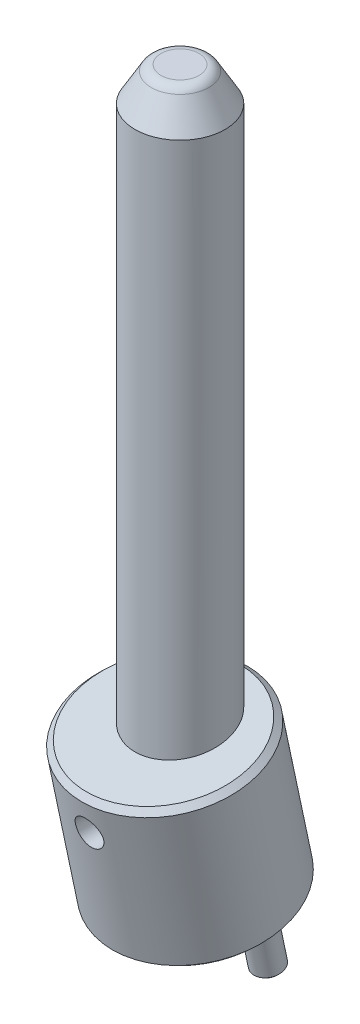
ISO-10303-21;
HEADER;
FILE_DESCRIPTION(('STEP AP214'),'2;1');
FILE_NAME('part.step','',(''),(''),'','','');
FILE_SCHEMA(('AUTOMOTIVE_DESIGN { 1 0 10303 214 1 1 1 1 }'));
ENDSEC;
DATA;
#1=APPLICATION_CONTEXT('core data for automotive mechanical design processes');
#2=APPLICATION_PROTOCOL_DEFINITION('international standard','automotive_design',2000,#1);
#3=PRODUCT_CONTEXT('',#1,'mechanical');
#4=PRODUCT('Part','Part','',(#3));
#5=PRODUCT_RELATED_PRODUCT_CATEGORY('part','',(#4));
#6=PRODUCT_DEFINITION_FORMATION('','',#4);
#7=PRODUCT_DEFINITION_CONTEXT('part definition',#1,'design');
#8=PRODUCT_DEFINITION('design','',#6,#7);
#9=PRODUCT_DEFINITION_SHAPE('','',#8);
#10=(LENGTH_UNIT() NAMED_UNIT(*) SI_UNIT(.MILLI.,.METRE.));
#11=(NAMED_UNIT(*) PLANE_ANGLE_UNIT() SI_UNIT($,.RADIAN.));
#12=(NAMED_UNIT(*) SI_UNIT($,.STERADIAN.) SOLID_ANGLE_UNIT());
#13=UNCERTAINTY_MEASURE_WITH_UNIT(LENGTH_MEASURE(1.E-05),#10,'distance_accuracy_value','');
#14=(GEOMETRIC_REPRESENTATION_CONTEXT(3) GLOBAL_UNCERTAINTY_ASSIGNED_CONTEXT((#13)) GLOBAL_UNIT_ASSIGNED_CONTEXT((#10,
#11,#12)) REPRESENTATION_CONTEXT('',''));
#15=CARTESIAN_POINT('',(0.,0.,0.));
#16=DIRECTION('',(0.,0.,1.));
#17=DIRECTION('',(1.,0.,0.));
#18=AXIS2_PLACEMENT_3D('',#15,#16,#17);
#19=CARTESIAN_POINT('',(0.,-11.3479748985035,-4.4464222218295));
#20=DIRECTION('',(0.,-0.978147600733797,-0.207911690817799));
#21=DIRECTION('',(0.,0.207911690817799,-0.978147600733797));
#22=AXIS2_PLACEMENT_3D('',#19,#20,#21);
#23=PLANE('',#22);
#24=CARTESIAN_POINT('',(-11.25,-11.3479748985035,-4.4464222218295));
#25=DIRECTION('',(0.,-0.978147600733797,-0.207911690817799));
#26=DIRECTION('',(0.,0.207911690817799,-0.978147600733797));
#27=AXIS2_PLACEMENT_3D('',#24,#25,#26);
#28=CIRCLE('',#27,1.9999654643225);
#29=CARTESIAN_POINT('',(-11.25,-10.932158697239,-6.402683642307));
#30=VERTEX_POINT('',#29);
#31=EDGE_CURVE('P0_E17',#30,#30,#28,.F.);
#32=ORIENTED_EDGE('',*,*,#31,.F.);
#33=EDGE_LOOP('',(#32));
#34=FACE_BOUND('',#33,.T.);
#35=ADVANCED_FACE('P0_F14',(#34),#23,.T.);
#36=CARTESIAN_POINT('',(0.,-11.3479748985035,-4.4464222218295));
#37=DIRECTION('',(0.,-0.978147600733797,-0.207911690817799));
#38=DIRECTION('',(0.,0.207911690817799,-0.978147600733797));
#39=AXIS2_PLACEMENT_3D('',#36,#37,#38);
#40=PLANE('',#39);
#41=CARTESIAN_POINT('',(11.25,-11.3479748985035,-4.4464222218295));
#42=DIRECTION('',(0.,-0.978147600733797,-0.207911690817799));
#43=DIRECTION('',(0.,0.207911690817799,-0.978147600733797));
#44=AXIS2_PLACEMENT_3D('',#41,#42,#43);
#45=CIRCLE('',#44,1.99996546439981);
#46=CARTESIAN_POINT('',(11.25,-10.9321586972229,-6.40268364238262));
#47=VERTEX_POINT('',#46);
#48=EDGE_CURVE('P0_E114',#47,#47,#45,.F.);
#49=ORIENTED_EDGE('',*,*,#48,.F.);
#50=EDGE_LOOP('',(#49));
#51=FACE_BOUND('',#50,.T.);
#52=ADVANCED_FACE('P0_F104',(#51),#40,.T.);
#53=CARTESIAN_POINT('',(0.,0.,-1.40946282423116E-13));
#54=DIRECTION('',(0.,-1.,0.));
#55=DIRECTION('',(0.,0.,-1.));
#56=AXIS2_PLACEMENT_3D('',#53,#54,#55);
#57=PLANE('',#56);
#58=CARTESIAN_POINT('',(0.,3.80771802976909E-13,4.43655528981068E-13));
#59=DIRECTION('',(0.,-1.,0.));
#60=DIRECTION('',(0.,0.,-1.));
#61=AXIS2_PLACEMENT_3D('',#58,#59,#60);
#62=CIRCLE('',#61,8.);
#63=CARTESIAN_POINT('',(0.,3.80771802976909E-13,-7.99999999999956));
#64=VERTEX_POINT('',#63);
#65=EDGE_CURVE('P0_E116',#64,#64,#62,.F.);
#66=ORIENTED_EDGE('',*,*,#65,.T.);
#67=EDGE_LOOP('',(#66));
#68=FACE_BOUND('',#67,.T.);
#69=ADVANCED_FACE('P0_F101',(#68),#57,.F.);
#70=CARTESIAN_POINT('',(-11.25,-10.858877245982,-4.34246130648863));
#71=DIRECTION('',(0.,0.978147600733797,0.207911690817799));
#72=DIRECTION('',(0.,-0.207911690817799,0.978147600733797));
#73=AXIS2_PLACEMENT_3D('',#70,#71,#72);
#74=CONICAL_SURFACE('',#73,2.49998121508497,0.78538952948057);
#75=CARTESIAN_POINT('',(-11.25,-10.8588588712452,-4.34245740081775));
#76=DIRECTION('',(0.,0.978147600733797,0.207911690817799));
#77=DIRECTION('',(0.,-0.207911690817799,0.978147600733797));
#78=AXIS2_PLACEMENT_3D('',#75,#76,#77);
#79=CIRCLE('',#78,2.5);
#80=CARTESIAN_POINT('',(-11.25,-11.3786380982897,-1.89708839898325));
#81=VERTEX_POINT('',#80);
#82=EDGE_CURVE('P0_E118',#81,#81,#79,.T.);
#83=ORIENTED_EDGE('',*,*,#82,.F.);
#84=EDGE_LOOP('',(#83));
#85=FACE_BOUND('',#84,.T.);
#86=ORIENTED_EDGE('',*,*,#31,.T.);
#87=EDGE_LOOP('',(#86));
#88=FACE_BOUND('',#87,.T.);
#89=ADVANCED_FACE('P0_F97',(#85,#88),#74,.T.);
#90=CARTESIAN_POINT('',(11.25,-10.858877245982,-4.34246130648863));
#91=DIRECTION('',(0.,0.978147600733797,0.207911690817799));
#92=DIRECTION('',(0.,-0.207911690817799,0.978147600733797));
#93=AXIS2_PLACEMENT_3D('',#90,#91,#92);
#94=CONICAL_SURFACE('',#93,2.49998121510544,0.785389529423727);
#95=CARTESIAN_POINT('',(11.25,-10.8588588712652,-4.342457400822));
#96=DIRECTION('',(0.,0.978147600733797,0.207911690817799));
#97=DIRECTION('',(0.,-0.207911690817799,0.978147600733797));
#98=AXIS2_PLACEMENT_3D('',#95,#96,#97);
#99=CIRCLE('',#98,2.5);
#100=CARTESIAN_POINT('',(11.25,-11.3786380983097,-1.89708839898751));
#101=VERTEX_POINT('',#100);
#102=EDGE_CURVE('P0_E123',#101,#101,#99,.T.);
#103=ORIENTED_EDGE('',*,*,#102,.F.);
#104=EDGE_LOOP('',(#103));
#105=FACE_BOUND('',#104,.T.);
#106=ORIENTED_EDGE('',*,*,#48,.T.);
#107=EDGE_LOOP('',(#106));
#108=FACE_BOUND('',#107,.T.);
#109=ADVANCED_FACE('P0_F92',(#105,#108),#94,.T.);
#110=CARTESIAN_POINT('',(0.,29.0896412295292,4.44522890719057E-13));
#111=DIRECTION('',(0.,-1.,0.));
#112=DIRECTION('',(0.,0.,-1.));
#113=AXIS2_PLACEMENT_3D('',#110,#111,#112);
#114=CYLINDRICAL_SURFACE('',#113,8.);
#115=CARTESIAN_POINT('',(0.,23.9999999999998,4.44089209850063E-13));
#116=DIRECTION('',(0.,0.978147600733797,0.207911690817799));
#117=DIRECTION('',(0.,-0.207911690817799,0.978147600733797));
#118=AXIS2_PLACEMENT_3D('',#115,#116,#117);
#119=ELLIPSE('',#118,8.17872475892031,8.);
#120=CARTESIAN_POINT('',(0.,22.2995475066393,8.00000000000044));
#121=VERTEX_POINT('',#120);
#122=EDGE_CURVE('P0_E79',#121,#121,#119,.F.);
#123=ORIENTED_EDGE('',*,*,#122,.F.);
#124=EDGE_LOOP('',(#123));
#125=FACE_BOUND('',#124,.T.);
#126=ORIENTED_EDGE('',*,*,#65,.F.);
#127=EDGE_LOOP('',(#126));
#128=FACE_BOUND('',#127,.T.);
#129=CARTESIAN_POINT('',(0.,16.5000000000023,8.00000000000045));
#130=CARTESIAN_POINT('',(-0.136696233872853,16.4999924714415,7.99999486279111));
#131=CARTESIAN_POINT('',(-0.273538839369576,16.4887368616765,7.99645812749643));
#132=CARTESIAN_POINT('',(-0.543359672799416,16.4440794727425,7.98267442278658));
#133=CARTESIAN_POINT('',(-0.676330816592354,16.4106394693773,7.97241587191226));
#134=CARTESIAN_POINT('',(-0.934271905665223,16.3228538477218,7.94631394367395));
#135=CARTESIAN_POINT('',(-1.05925832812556,16.2685530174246,7.93048253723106));
#136=CARTESIAN_POINT('',(-1.2983071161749,16.1407422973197,7.89487323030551));
#137=CARTESIAN_POINT('',(-1.4123711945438,16.0672354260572,7.87509595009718));
#138=CARTESIAN_POINT('',(-1.62992724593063,15.9006902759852,7.83300483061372));
#139=CARTESIAN_POINT('',(-1.73303436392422,15.8071632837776,7.8106355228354));
#140=CARTESIAN_POINT('',(-1.92239021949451,15.604269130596,7.76620212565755));
#141=CARTESIAN_POINT('',(-2.00863490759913,15.4948981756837,7.74413811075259));
#142=CARTESIAN_POINT('',(-2.16388692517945,15.2601105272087,7.70222283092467));
#143=CARTESIAN_POINT('',(-2.23241606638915,15.1343643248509,7.68243965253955));
#144=CARTESIAN_POINT('',(-2.34719509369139,14.87241459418,7.64815595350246));
#145=CARTESIAN_POINT('',(-2.3934509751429,14.7362138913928,7.63365401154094));
#146=CARTESIAN_POINT('',(-2.4609691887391,14.4615438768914,7.61215214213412));
#147=CARTESIAN_POINT('',(-2.48294218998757,14.3232663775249,7.60493946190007));
#148=CARTESIAN_POINT('',(-2.50349110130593,14.0448138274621,7.59820110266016));
#149=CARTESIAN_POINT('',(-2.50207322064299,13.9046392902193,7.59867338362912));
#150=CARTESIAN_POINT('',(-2.47643652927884,13.632251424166,7.60706377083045));
#151=CARTESIAN_POINT('',(-2.45312128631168,13.4999424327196,7.6146867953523));
#152=CARTESIAN_POINT('',(-2.38581648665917,13.2412163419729,7.63604044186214));
#153=CARTESIAN_POINT('',(-2.34182462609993,13.1147999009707,7.64977174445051));
#154=CARTESIAN_POINT('',(-2.23377596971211,12.8692925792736,7.68202134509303));
#155=CARTESIAN_POINT('',(-2.16943495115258,12.7503359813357,7.70060675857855));
#156=CARTESIAN_POINT('',(-2.02271557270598,12.5246183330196,7.74043834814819));
#157=CARTESIAN_POINT('',(-1.94033355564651,12.4178597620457,7.76168506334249));
#158=CARTESIAN_POINT('',(-1.75545127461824,12.2144687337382,7.80562654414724));
#159=CARTESIAN_POINT('',(-1.65220788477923,12.1185153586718,7.82834327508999));
#160=CARTESIAN_POINT('',(-1.43076939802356,11.9450838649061,7.87182395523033));
#161=CARTESIAN_POINT('',(-1.31256787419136,11.8676137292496,7.89258705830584));
#162=CARTESIAN_POINT('',(-1.06322528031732,11.7328853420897,7.93004255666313));
#163=CARTESIAN_POINT('',(-0.931982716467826,11.6758045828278,7.94669883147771));
#164=CARTESIAN_POINT('',(-0.661263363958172,11.5848318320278,7.97377752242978));
#165=CARTESIAN_POINT('',(-0.52180416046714,11.5508921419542,7.9842127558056));
#166=CARTESIAN_POINT('',(-0.317572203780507,11.5194323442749,7.99394471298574));
#167=CARTESIAN_POINT('',(-0.254308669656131,11.5121536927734,7.99620897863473));
#168=CARTESIAN_POINT('',(-0.127374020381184,11.5024357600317,7.99923782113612));
#169=CARTESIAN_POINT('',(-0.0637029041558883,11.4999964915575,8.00000239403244));
#170=CARTESIAN_POINT('',(0.136696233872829,11.500007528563,7.99999486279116));
#171=CARTESIAN_POINT('',(0.273538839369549,11.5112631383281,7.99645812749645));
#172=CARTESIAN_POINT('',(0.543359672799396,11.5559205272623,7.98267442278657));
#173=CARTESIAN_POINT('',(0.676330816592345,11.5893605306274,7.97241587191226));
#174=CARTESIAN_POINT('',(0.934271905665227,11.6771461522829,7.94631394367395));
#175=CARTESIAN_POINT('',(1.05925832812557,11.7314469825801,7.93048253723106));
#176=CARTESIAN_POINT('',(1.2983071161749,11.859257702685,7.89487323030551));
#177=CARTESIAN_POINT('',(1.4123711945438,11.9327645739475,7.87509595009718));
#178=CARTESIAN_POINT('',(1.62992724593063,12.0993097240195,7.83300483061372));
#179=CARTESIAN_POINT('',(1.73303436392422,12.1928367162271,7.8106355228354));
#180=CARTESIAN_POINT('',(1.92239021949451,12.3957308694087,7.76620212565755));
#181=CARTESIAN_POINT('',(2.00863490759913,12.505101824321,7.74413811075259));
#182=CARTESIAN_POINT('',(2.16388692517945,12.739889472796,7.70222283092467));
#183=CARTESIAN_POINT('',(2.23241606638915,12.8656356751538,7.68243965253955));
#184=CARTESIAN_POINT('',(2.34719509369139,13.1275854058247,7.64815595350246));
#185=CARTESIAN_POINT('',(2.3934509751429,13.2637861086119,7.63365401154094));
#186=CARTESIAN_POINT('',(2.4609691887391,13.5384561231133,7.61215214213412));
#187=CARTESIAN_POINT('',(2.48294218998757,13.6767336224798,7.60493946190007));
#188=CARTESIAN_POINT('',(2.50349110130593,13.9551861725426,7.59820110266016));
#189=CARTESIAN_POINT('',(2.50207322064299,14.0953607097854,7.59867338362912));
#190=CARTESIAN_POINT('',(2.47643652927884,14.3677485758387,7.60706377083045));
#191=CARTESIAN_POINT('',(2.45312128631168,14.5000575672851,7.6146867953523));
#192=CARTESIAN_POINT('',(2.38581648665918,14.7587836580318,7.63604044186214));
#193=CARTESIAN_POINT('',(2.34182462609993,14.885200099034,7.64977174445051));
#194=CARTESIAN_POINT('',(2.23377596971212,15.1307074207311,7.68202134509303));
#195=CARTESIAN_POINT('',(2.16943495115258,15.249664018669,7.70060675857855));
#196=CARTESIAN_POINT('',(2.02271557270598,15.4753816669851,7.74043834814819));
#197=CARTESIAN_POINT('',(1.94033355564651,15.582140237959,7.76168506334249));
#198=CARTESIAN_POINT('',(1.75545127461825,15.7855312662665,7.80562654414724));
#199=CARTESIAN_POINT('',(1.65220788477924,15.8814846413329,7.82834327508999));
#200=CARTESIAN_POINT('',(1.43076939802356,16.0549161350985,7.87182395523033));
#201=CARTESIAN_POINT('',(1.31256787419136,16.132386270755,7.89258705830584));
#202=CARTESIAN_POINT('',(1.06322528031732,16.267114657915,7.93004255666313));
#203=CARTESIAN_POINT('',(0.931982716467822,16.3241954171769,7.94669883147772));
#204=CARTESIAN_POINT('',(0.661263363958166,16.4151681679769,7.97377752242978));
#205=CARTESIAN_POINT('',(0.521804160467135,16.4491078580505,7.98421275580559));
#206=CARTESIAN_POINT('',(0.317572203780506,16.4805676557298,7.99394471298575));
#207=CARTESIAN_POINT('',(0.25430866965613,16.4878463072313,7.99620897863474));
#208=CARTESIAN_POINT('',(0.127374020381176,16.4975642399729,7.99923782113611));
#209=CARTESIAN_POINT('',(0.0637029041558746,16.5000035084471,8.00000239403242));
#210=CARTESIAN_POINT('',(0.,16.5000000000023,8.00000000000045));
#211=B_SPLINE_CURVE_WITH_KNOTS('',3,(#129,#130,#131,#132,#133,#134,#135,#136,#137,#138,#139,
#140,#141,#142,#143,#144,#145,#146,#147,#148,#149,#150,#151,#152,#153,#154,#155,#156,#157,#158,
#159,#160,#161,#162,#163,#164,#165,#166,#167,#168,#169,#170,#171,#172,#173,#174,#175,#176,#177,
#178,#179,#180,#181,#182,#183,#184,#185,#186,#187,#188,#189,#190,#191,#192,#193,#194,#195,#196,
#197,#198,#199,#200,#201,#202,#203,#204,#205,#206,#207,#208,#209,#210),.UNSPECIFIED.,.T.,.F.,(4,
2,2,2,2,2,2,2,2,2,2,2,2,2,2,2,2,2,2,2,2,2,2,2,2,2,2,2,2,2,2,2,2,2,2,2,2,2,2,2,4),(0.,
0.409843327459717,0.820394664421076,1.23006943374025,1.63967985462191,2.06074511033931,
2.48191136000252,2.91347666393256,3.34492573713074,3.76338291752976,4.18172901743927,
4.58353732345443,4.9853904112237,5.39312450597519,5.80094133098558,6.22725884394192,
6.65376015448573,7.08388858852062,7.51312773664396,7.70412159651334,7.89511596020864,
8.30495928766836,8.71551062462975,9.12518539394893,9.53479581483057,9.95586107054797,
10.3770273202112,10.8085926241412,11.2400416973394,11.6584988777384,12.0768449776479,
12.4786532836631,12.8805063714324,13.2882404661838,13.6960572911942,14.1223748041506,
14.5488761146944,14.9790045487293,15.4082436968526,15.599237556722,15.7902319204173),.UNSPECIFIED.);
#212=CARTESIAN_POINT('',(0.,16.5000000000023,8.00000000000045));
#213=VERTEX_POINT('',#212);
#214=EDGE_CURVE('P0_E76',#213,#213,#211,.T.);
#215=ORIENTED_EDGE('',*,*,#214,.T.);
#216=EDGE_LOOP('',(#215));
#217=FACE_BOUND('',#216,.T.);
#218=ADVANCED_FACE('P0_F86',(#125,#128,#217),#114,.F.);
#219=CARTESIAN_POINT('',(-11.25,-4.011867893,-2.887084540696));
#220=DIRECTION('',(0.,-0.978147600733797,-0.207911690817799));
#221=DIRECTION('',(0.,0.207911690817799,-0.978147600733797));
#222=AXIS2_PLACEMENT_3D('',#219,#220,#221);
#223=CYLINDRICAL_SURFACE('',#222,2.5);
#224=CARTESIAN_POINT('',(-11.25,-4.011867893,-2.887084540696));
#225=DIRECTION('',(0.,-0.978147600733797,-0.207911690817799));
#226=DIRECTION('',(0.,0.207911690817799,-0.978147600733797));
#227=AXIS2_PLACEMENT_3D('',#224,#225,#226);
#228=CIRCLE('',#227,2.5);
#229=CARTESIAN_POINT('',(-11.25,-3.4920886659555,-5.33245354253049));
#230=VERTEX_POINT('',#229);
#231=EDGE_CURVE('P0_E72',#230,#230,#228,.T.);
#232=ORIENTED_EDGE('',*,*,#231,.T.);
#233=EDGE_LOOP('',(#232));
#234=FACE_BOUND('',#233,.T.);
#235=ORIENTED_EDGE('',*,*,#82,.T.);
#236=EDGE_LOOP('',(#235));
#237=FACE_BOUND('',#236,.T.);
#238=ADVANCED_FACE('P0_F91',(#234,#237),#223,.T.);
#239=CARTESIAN_POINT('',(11.25,-4.011867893,-2.887084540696));
#240=DIRECTION('',(0.,-0.978147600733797,-0.207911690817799));
#241=DIRECTION('',(0.,0.207911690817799,-0.978147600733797));
#242=AXIS2_PLACEMENT_3D('',#239,#240,#241);
#243=CYLINDRICAL_SURFACE('',#242,2.5);
#244=CARTESIAN_POINT('',(11.25,-4.011867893,-2.887084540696));
#245=DIRECTION('',(0.,-0.978147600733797,-0.207911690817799));
#246=DIRECTION('',(0.,0.207911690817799,-0.978147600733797));
#247=AXIS2_PLACEMENT_3D('',#244,#245,#246);
#248=CIRCLE('',#247,2.5);
#249=CARTESIAN_POINT('',(11.25,-3.4920886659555,-5.33245354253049));
#250=VERTEX_POINT('',#249);
#251=EDGE_CURVE('P0_E68',#250,#250,#248,.T.);
#252=ORIENTED_EDGE('',*,*,#251,.T.);
#253=EDGE_LOOP('',(#252));
#254=FACE_BOUND('',#253,.T.);
#255=ORIENTED_EDGE('',*,*,#102,.T.);
#256=EDGE_LOOP('',(#255));
#257=FACE_BOUND('',#256,.T.);
#258=ADVANCED_FACE('P0_F139',(#254,#257),#243,.T.);
#259=CARTESIAN_POINT('',(0.,23.3762649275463,2.93444280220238));
#260=DIRECTION('',(0.,0.978147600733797,0.207911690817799));
#261=DIRECTION('',(0.,-0.207911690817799,0.978147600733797));
#262=AXIS2_PLACEMENT_3D('',#259,#260,#261);
#263=PLANE('',#262);
#264=ORIENTED_EDGE('',*,*,#122,.T.);
#265=EDGE_LOOP('',(#264));
#266=FACE_BOUND('',#265,.T.);
#267=CARTESIAN_POINT('',(0.,23.3762642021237,2.93444264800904));
#268=DIRECTION('',(0.,-0.978147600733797,-0.207911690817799));
#269=DIRECTION('',(0.,0.207911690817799,-0.978147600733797));
#270=AXIS2_PLACEMENT_3D('',#267,#268,#269);
#271=CIRCLE('',#270,13.999998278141);
#272=CARTESIAN_POINT('',(0.,26.2870275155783,-10.7596220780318));
#273=VERTEX_POINT('',#272);
#274=EDGE_CURVE('P0_E38',#273,#273,#271,.T.);
#275=ORIENTED_EDGE('',*,*,#274,.F.);
#276=EDGE_LOOP('',(#275));
#277=FACE_BOUND('',#276,.T.);
#278=ADVANCED_FACE('P0_F63',(#266,#277),#263,.T.);
#279=CARTESIAN_POINT('',(0.,14.0000000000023,-3.19382426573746));
#280=DIRECTION('',(0.,0.,1.));
#281=DIRECTION('',(0.,-1.,0.));
#282=AXIS2_PLACEMENT_3D('',#279,#280,#281);
#283=CYLINDRICAL_SURFACE('',#282,2.5);
#284=ORIENTED_EDGE('',*,*,#214,.F.);
#285=EDGE_LOOP('',(#284));
#286=FACE_BOUND('',#285,.T.);
#287=CARTESIAN_POINT('',(0.,11.5000000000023,15.7451736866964));
#288=CARTESIAN_POINT('',(-0.140107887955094,11.5000063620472,15.7451722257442));
#289=CARTESIAN_POINT('',(-0.280383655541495,11.5118241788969,15.7456579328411));
#290=CARTESIAN_POINT('',(-0.557146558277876,11.5588205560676,15.7477509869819));
#291=CARTESIAN_POINT('',(-0.693625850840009,11.5940442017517,15.7493604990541));
#292=CARTESIAN_POINT('',(-0.958652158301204,11.68684810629,15.7541401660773));
#293=CARTESIAN_POINT('',(-1.08720447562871,11.7444132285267,15.7573092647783));
#294=CARTESIAN_POINT('',(-1.33272880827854,11.880209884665,15.7658612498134));
#295=CARTESIAN_POINT('',(-1.44970582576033,11.9584324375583,15.7712431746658));
#296=CARTESIAN_POINT('',(-1.66863906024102,12.1331247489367,15.7849832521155));
#297=CARTESIAN_POINT('',(-1.770618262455,12.2295660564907,15.7933367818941));
#298=CARTESIAN_POINT('',(-1.95688343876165,12.4379077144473,15.8137776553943));
#299=CARTESIAN_POINT('',(-2.04116897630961,12.5498084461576,15.8258650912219));
#300=CARTESIAN_POINT('',(-2.18946472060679,12.7852827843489,15.8543210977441));
#301=CARTESIAN_POINT('',(-2.25354371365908,12.9088148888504,15.8706747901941));
#302=CARTESIAN_POINT('',(-2.3602000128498,13.1641747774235,15.9079831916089));
#303=CARTESIAN_POINT('',(-2.40277753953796,13.296002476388,15.9289378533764));
#304=CARTESIAN_POINT('',(-2.46571399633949,13.5647913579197,15.9754897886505));
#305=CARTESIAN_POINT('',(-2.48595736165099,13.7017754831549,16.0011104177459));
#306=CARTESIAN_POINT('',(-2.50367374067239,13.9763837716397,16.0564250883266));
#307=CARTESIAN_POINT('',(-2.50114389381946,14.1140080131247,16.0861196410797));
#308=CARTESIAN_POINT('',(-2.47343299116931,14.3895750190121,16.1494570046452));
#309=CARTESIAN_POINT('',(-2.44770367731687,14.5274444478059,16.1831781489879));
#310=CARTESIAN_POINT('',(-2.37382659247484,14.7965064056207,16.2526665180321));
#311=CARTESIAN_POINT('',(-2.32567388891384,14.9276974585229,16.2884341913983));
#312=CARTESIAN_POINT('',(-2.20639437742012,15.1842631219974,16.3616120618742));
#313=CARTESIAN_POINT('',(-2.13457256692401,15.3093107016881,16.3990378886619));
#314=CARTESIAN_POINT('',(-1.97029258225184,15.5455241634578,16.4724437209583));
#315=CARTESIAN_POINT('',(-1.8778333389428,15.6566893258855,16.5084236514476));
#316=CARTESIAN_POINT('',(-1.67389018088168,15.8625805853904,16.5770492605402));
#317=CARTESIAN_POINT('',(-1.56229929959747,15.9572078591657,16.6096744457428));
#318=CARTESIAN_POINT('',(-1.32321508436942,16.1261494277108,16.6692003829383));
#319=CARTESIAN_POINT('',(-1.19571842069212,16.200459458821,16.6960999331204));
#320=CARTESIAN_POINT('',(-0.934046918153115,16.3232708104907,16.7411944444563));
#321=CARTESIAN_POINT('',(-0.800368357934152,16.3727147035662,16.7597041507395));
#322=CARTESIAN_POINT('',(-0.525909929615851,16.4481759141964,16.7881514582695));
#323=CARTESIAN_POINT('',(-0.385150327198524,16.4742564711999,16.7981121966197));
#324=CARTESIAN_POINT('',(-0.202848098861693,16.4920900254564,16.8049293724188));
#325=CARTESIAN_POINT('',(-0.162348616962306,16.495053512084,16.8060629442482));
#326=CARTESIAN_POINT('',(-0.0812385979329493,16.4990094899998,16.8075770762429));
#327=CARTESIAN_POINT('',(-0.0406280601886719,16.5000019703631,16.8079576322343));
#328=CARTESIAN_POINT('',(0.134196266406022,16.4999934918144,16.8079527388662));
#329=CARTESIAN_POINT('',(0.268583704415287,16.4891374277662,16.8037846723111));
#330=CARTESIAN_POINT('',(0.533576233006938,16.4460970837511,16.7873961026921));
#331=CARTESIAN_POINT('',(0.664172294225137,16.4138656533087,16.7751577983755));
#332=CARTESIAN_POINT('',(0.917420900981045,16.3293993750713,16.7435328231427));
#333=CARTESIAN_POINT('',(1.04009312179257,16.2772164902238,16.7241647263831));
#334=CARTESIAN_POINT('',(1.2747246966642,16.1546700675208,16.6795542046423));
#335=CARTESIAN_POINT('',(1.38668719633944,16.0843118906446,16.6543135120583));
#336=CARTESIAN_POINT('',(1.60110639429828,15.9248164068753,16.5984986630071));
#337=CARTESIAN_POINT('',(1.70310445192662,15.8351170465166,16.5677710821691));
#338=CARTESIAN_POINT('',(1.8908718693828,15.6409920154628,16.5033463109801));
#339=CARTESIAN_POINT('',(1.97663559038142,15.5365612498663,16.4696480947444));
#340=CARTESIAN_POINT('',(2.13448955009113,15.3092616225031,16.3990336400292));
#341=CARTESIAN_POINT('',(2.20552533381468,15.1856820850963,16.3620433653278));
#342=CARTESIAN_POINT('',(2.32567188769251,14.9281418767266,16.2885349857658));
#343=CARTESIAN_POINT('',(2.37477922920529,14.7941795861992,16.2520169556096));
#344=CARTESIAN_POINT('',(2.45037879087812,14.5164913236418,16.1804008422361));
#345=CARTESIAN_POINT('',(2.47638794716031,14.3726216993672,16.145347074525));
#346=CARTESIAN_POINT('',(2.50292807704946,14.0817041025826,16.0789445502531));
#347=CARTESIAN_POINT('',(2.50346256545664,13.9346565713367,16.0475952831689));
#348=CARTESIAN_POINT('',(2.47884653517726,13.6450971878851,15.9902851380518));
#349=CARTESIAN_POINT('',(2.45427088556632,13.5025575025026,15.9642193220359));
#350=CARTESIAN_POINT('',(2.38060543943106,13.2230913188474,15.9171142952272));
#351=CARTESIAN_POINT('',(2.33152009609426,13.086163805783,15.8960741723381));
#352=CARTESIAN_POINT('',(2.21197910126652,12.8265805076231,15.8596129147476));
#353=CARTESIAN_POINT('',(2.14225849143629,12.7036080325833,15.8440333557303));
#354=CARTESIAN_POINT('',(1.98283632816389,12.4708667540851,15.8171865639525));
#355=CARTESIAN_POINT('',(1.89313780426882,12.3610959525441,15.8059186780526));
#356=CARTESIAN_POINT('',(1.69771009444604,12.1595628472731,15.7871579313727));
#357=CARTESIAN_POINT('',(1.5922254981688,12.0675678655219,15.7796139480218));
#358=CARTESIAN_POINT('',(1.36724037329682,11.9023500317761,15.7672958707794));
#359=CARTESIAN_POINT('',(1.24773397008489,11.829135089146,15.7625229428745));
#360=CARTESIAN_POINT('',(0.99791347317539,11.7035315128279,15.754998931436));
#361=CARTESIAN_POINT('',(0.867578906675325,11.6511834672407,15.7522517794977));
#362=CARTESIAN_POINT('',(0.600139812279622,11.5690883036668,15.7481884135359));
#363=CARTESIAN_POINT('',(0.463048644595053,11.5392983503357,15.7468694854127));
#364=CARTESIAN_POINT('',(0.270787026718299,11.514113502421,15.7457743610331));
#365=CARTESIAN_POINT('',(0.2167725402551,11.508825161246,15.7455479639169));
#366=CARTESIAN_POINT('',(0.108513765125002,11.5017671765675,15.7452479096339));
#367=CARTESIAN_POINT('',(0.054269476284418,11.499997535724,15.7451742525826));
#368=CARTESIAN_POINT('',(0.,11.5000000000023,15.7451736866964));
#369=B_SPLINE_CURVE_WITH_KNOTS('',3,(#287,#288,#289,#290,#291,#292,#293,#294,#295,#296,#297,
#298,#299,#300,#301,#302,#303,#304,#305,#306,#307,#308,#309,#310,#311,#312,#313,#314,#315,#316,
#317,#318,#319,#320,#321,#322,#323,#324,#325,#326,#327,#328,#329,#330,#331,#332,#333,#334,#335,
#336,#337,#338,#339,#340,#341,#342,#343,#344,#345,#346,#347,#348,#349,#350,#351,#352,#353,#354,
#355,#356,#357,#358,#359,#360,#361,#362,#363,#364,#365,#366,#367,#368),.UNSPECIFIED.,.T.,.F.,(4,
2,2,2,2,2,2,2,2,2,2,2,2,2,2,2,2,2,2,2,2,2,2,2,2,2,2,2,2,2,2,2,2,2,2,2,2,2,2,2,4),(0.,
0.420119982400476,0.841051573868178,1.26169847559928,1.68216279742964,2.10197585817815,
2.52179927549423,2.94017772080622,3.35855187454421,3.77908083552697,4.19966262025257,
4.63045198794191,5.06133616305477,5.50620682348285,5.95110053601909,6.39856803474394,
6.8461293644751,7.27512848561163,7.70296286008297,7.82479737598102,7.94663256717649,
8.34905955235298,8.75237718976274,9.15465147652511,9.55680724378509,9.97277727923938,
10.3888915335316,10.8286607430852,11.2684986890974,11.7173321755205,12.1661037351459,
12.604826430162,13.0434694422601,13.4680592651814,13.8925847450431,14.3111078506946,
14.7298069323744,15.1493164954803,15.5680274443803,15.7307568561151,15.8934863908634),.UNSPECIFIED.);
#370=CARTESIAN_POINT('',(0.,11.5000000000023,15.7451736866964));
#371=VERTEX_POINT('',#370);
#372=EDGE_CURVE('P0_E31',#371,#371,#369,.T.);
#373=ORIENTED_EDGE('',*,*,#372,.F.);
#374=EDGE_LOOP('',(#373));
#375=FACE_BOUND('',#374,.T.);
#376=ADVANCED_FACE('P0_F40',(#286,#375),#283,.F.);
#377=CARTESIAN_POINT('',(0.,-4.011867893,-2.887084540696));
#378=DIRECTION('',(0.,0.978147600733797,0.207911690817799));
#379=DIRECTION('',(0.,-0.207911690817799,0.978147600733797));
#380=AXIS2_PLACEMENT_3D('',#377,#378,#379);
#381=PLANE('',#380);
#382=ORIENTED_EDGE('',*,*,#251,.F.);
#383=EDGE_LOOP('',(#382));
#384=FACE_BOUND('',#383,.T.);
#385=ORIENTED_EDGE('',*,*,#231,.F.);
#386=EDGE_LOOP('',(#385));
#387=FACE_BOUND('',#386,.T.);
#388=CARTESIAN_POINT('',(0.,-4.01186714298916,-2.88708438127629));
#389=DIRECTION('',(0.,0.978147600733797,0.207911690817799));
#390=DIRECTION('',(0.,-0.207911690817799,0.978147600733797));
#391=AXIS2_PLACEMENT_3D('',#388,#389,#390);
#392=CIRCLE('',#391,13.99999802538);
#393=CARTESIAN_POINT('',(0.,-6.92263040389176,10.806980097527));
#394=VERTEX_POINT('',#393);
#395=EDGE_CURVE('P0_E26',#394,#394,#392,.T.);
#396=ORIENTED_EDGE('',*,*,#395,.F.);
#397=EDGE_LOOP('',(#396));
#398=FACE_BOUND('',#397,.T.);
#399=ADVANCED_FACE('P0_F55',(#384,#387,#398),#381,.F.);
#400=CARTESIAN_POINT('',(0.,22.3981155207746,2.72653072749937));
#401=DIRECTION('',(0.,-0.978147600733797,-0.207911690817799));
#402=DIRECTION('',(0.,0.207911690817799,-0.978147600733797));
#403=AXIS2_PLACEMENT_3D('',#400,#401,#402);
#404=CONICAL_SURFACE('',#403,14.999999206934,0.785398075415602);
#405=ORIENTED_EDGE('',*,*,#274,.T.);
#406=EDGE_LOOP('',(#405));
#407=FACE_BOUND('',#406,.T.);
#408=CARTESIAN_POINT('',(0.,22.3981162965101,2.72653089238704));
#409=DIRECTION('',(0.,0.978147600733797,0.207911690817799));
#410=DIRECTION('',(0.,-0.207911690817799,0.978147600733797));
#411=AXIS2_PLACEMENT_3D('',#408,#409,#410);
#412=CIRCLE('',#411,15.);
#413=CARTESIAN_POINT('',(0.,19.2794409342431,17.398744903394));
#414=VERTEX_POINT('',#413);
#415=EDGE_CURVE('P0_E21',#414,#414,#412,.F.);
#416=ORIENTED_EDGE('',*,*,#415,.F.);
#417=EDGE_LOOP('',(#416));
#418=FACE_BOUND('',#417,.T.);
#419=ADVANCED_FACE('P0_F52',(#407,#418),#404,.T.);
#420=CARTESIAN_POINT('',(0.,-3.03371822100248,-2.67917240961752));
#421=DIRECTION('',(0.,0.978147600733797,0.207911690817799));
#422=DIRECTION('',(0.,-0.207911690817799,0.978147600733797));
#423=AXIS2_PLACEMENT_3D('',#420,#421,#422);
#424=CONICAL_SURFACE('',#423,14.9999991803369,0.785398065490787);
#425=CARTESIAN_POINT('',(0.,-3.03371902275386,-2.67917258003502));
#426=DIRECTION('',(0.,0.978147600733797,0.207911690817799));
#427=DIRECTION('',(0.,-0.207911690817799,0.978147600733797));
#428=AXIS2_PLACEMENT_3D('',#425,#426,#427);
#429=CIRCLE('',#428,15.);
#430=CARTESIAN_POINT('',(0.,-6.15239438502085,11.9930414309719));
#431=VERTEX_POINT('',#430);
#432=EDGE_CURVE('P0_E9',#431,#431,#429,.T.);
#433=ORIENTED_EDGE('',*,*,#432,.F.);
#434=EDGE_LOOP('',(#433));
#435=FACE_BOUND('',#434,.T.);
#436=ORIENTED_EDGE('',*,*,#395,.T.);
#437=EDGE_LOOP('',(#436));
#438=FACE_BOUND('',#437,.T.);
#439=ADVANCED_FACE('P0_F48',(#435,#438),#424,.T.);
#440=CARTESIAN_POINT('',(0.,-5.38127453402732,-3.17816090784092));
#441=DIRECTION('',(0.,0.978147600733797,0.207911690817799));
#442=DIRECTION('',(0.,-0.207911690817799,0.978147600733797));
#443=AXIS2_PLACEMENT_3D('',#440,#441,#442);
#444=CYLINDRICAL_SURFACE('',#443,15.);
#445=ORIENTED_EDGE('',*,*,#415,.T.);
#446=EDGE_LOOP('',(#445));
#447=FACE_BOUND('',#446,.T.);
#448=ORIENTED_EDGE('',*,*,#432,.T.);
#449=EDGE_LOOP('',(#448));
#450=FACE_BOUND('',#449,.T.);
#451=ORIENTED_EDGE('',*,*,#372,.T.);
#452=EDGE_LOOP('',(#451));
#453=FACE_BOUND('',#452,.T.);
#454=ADVANCED_FACE('P0_F44',(#447,#450,#453),#444,.T.);
#455=CLOSED_SHELL('',(#35,#52,#69,#89,#109,#218,#238,#258,#278,#376,#399,#419,#439,#454));
#456=MANIFOLD_SOLID_BREP('P0_B1',#455);
#457=CARTESIAN_POINT('',(0.,124.,0.));
#458=DIRECTION('',(0.,1.,0.));
#459=DIRECTION('',(-1.,0.,0.));
#460=AXIS2_PLACEMENT_3D('',#457,#458,#459);
#461=PLANE('',#460);
#462=CARTESIAN_POINT('',(0.,124.,-3.381197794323));
#463=CARTESIAN_POINT('',(0.0491775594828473,124.,-3.38119852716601));
#464=CARTESIAN_POINT('',(0.0983550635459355,124.,-3.38012493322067));
#465=CARTESIAN_POINT('',(0.196616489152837,124.,-3.3758343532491));
#466=CARTESIAN_POINT('',(0.24570041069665,124.,-3.37261736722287));
#467=CARTESIAN_POINT('',(0.343681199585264,124.,-3.36404526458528));
#468=CARTESIAN_POINT('',(0.392578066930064,124.,-3.35869014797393));
#469=CARTESIAN_POINT('',(0.490091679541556,124.,-3.34585220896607));
#470=CARTESIAN_POINT('',(0.538708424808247,124.,-3.33836938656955));
#471=CARTESIAN_POINT('',(0.635569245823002,124.,-3.32129021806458));
#472=CARTESIAN_POINT('',(0.683813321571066,124.,-3.31169387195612));
#473=CARTESIAN_POINT('',(0.779836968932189,124.,-3.29040593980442));
#474=CARTESIAN_POINT('',(0.827616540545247,124.,-3.27871435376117));
#475=CARTESIAN_POINT('',(0.922620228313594,124.,-3.25325819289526));
#476=CARTESIAN_POINT('',(0.969844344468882,124.,-3.2394936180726));
#477=CARTESIAN_POINT('',(1.06364722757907,124.,-3.20991768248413));
#478=CARTESIAN_POINT('',(1.11022599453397,124.,-3.19410632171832));
#479=CARTESIAN_POINT('',(1.2026495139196,124.,-3.1604669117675));
#480=CARTESIAN_POINT('',(1.24849426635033,124.,-3.14263886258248));
#481=CARTESIAN_POINT('',(1.33936248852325,124.,-3.10500001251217));
#482=CARTESIAN_POINT('',(1.38438595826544,124.,-3.08518921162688));
#483=CARTESIAN_POINT('',(1.47352591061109,124.,-3.04362256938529));
#484=CARTESIAN_POINT('',(1.51764239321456,124.,-3.02186672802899));
#485=CARTESIAN_POINT('',(1.60488439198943,124.,-2.97645141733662));
#486=CARTESIAN_POINT('',(1.64800990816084,124.,-2.95279194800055));
#487=CARTESIAN_POINT('',(1.73318788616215,124.,-2.90361442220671));
#488=CARTESIAN_POINT('',(1.77524034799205,124.,-2.87809636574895));
#489=CARTESIAN_POINT('',(1.85819215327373,124.,-2.82525022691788));
#490=CARTESIAN_POINT('',(1.89909149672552,124.,-2.79792214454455));
#491=CARTESIAN_POINT('',(1.97965926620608,124.,-2.74150802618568));
#492=CARTESIAN_POINT('',(2.01932769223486,124.,-2.71242199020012));
#493=CARTESIAN_POINT('',(2.09735790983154,124.,-2.65254713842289));
#494=CARTESIAN_POINT('',(2.13571970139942,123.999999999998,-2.62175832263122));
#495=CARTESIAN_POINT('',(2.21106439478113,124.000000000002,-2.55853724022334));
#496=CARTESIAN_POINT('',(2.24804729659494,124.000000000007,-2.52610497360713));
#497=CARTESIAN_POINT('',(2.32056094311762,123.999999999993,-2.45965603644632));
#498=CARTESIAN_POINT('',(2.35609168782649,123.999999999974,-2.42563936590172));
#499=CARTESIAN_POINT('',(2.42705213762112,124.000000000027,-2.35468855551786));
#500=CARTESIAN_POINT('',(2.46241950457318,124.000000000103,-2.31769205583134));
#501=CARTESIAN_POINT('',(2.53146011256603,123.999999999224,-2.24214947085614));
#502=CARTESIAN_POINT('',(2.56513331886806,123.999999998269,-2.20360335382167));
#503=CARTESIAN_POINT('',(2.63071590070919,123.99999999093,-2.12503640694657));
#504=CARTESIAN_POINT('',(2.66262520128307,123.999999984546,-2.08501551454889));
#505=CARTESIAN_POINT('',(2.72461562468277,123.999999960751,-2.00357584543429));
#506=CARTESIAN_POINT('',(2.75469662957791,123.999999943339,-1.96215697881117));
#507=CARTESIAN_POINT('',(2.79840512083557,123.999999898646,-1.89905244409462));
#508=CARTESIAN_POINT('',(2.81273996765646,123.999999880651,-1.87785353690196));
#509=CARTESIAN_POINT('',(2.84090934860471,123.999999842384,-1.83514783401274));
#510=CARTESIAN_POINT('',(2.8547442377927,123.999999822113,-1.81364127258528));
#511=CARTESIAN_POINT('',(2.8954872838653,123.999999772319,-1.7486424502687));
#512=CARTESIAN_POINT('',(2.921634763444,123.999999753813,-1.7046696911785));
#513=CARTESIAN_POINT('',(2.97183520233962,123.999999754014,-1.61554840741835));
#514=CARTESIAN_POINT('',(2.99588817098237,123.99999977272,-1.57039988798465));
#515=CARTESIAN_POINT('',(3.04188859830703,123.999999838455,-1.47904330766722));
#516=CARTESIAN_POINT('',(3.06383619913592,123.999999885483,-1.4328353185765));
#517=CARTESIAN_POINT('',(3.10541271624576,123.999999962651,-1.33939702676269));
#518=CARTESIAN_POINT('',(3.12504193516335,123.999999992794,-1.2921668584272));
#519=CARTESIAN_POINT('',(3.15291976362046,124.000000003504,-1.22146858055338));
#520=CARTESIAN_POINT('',(3.16183489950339,124.000000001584,-1.19825675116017));
#521=CARTESIAN_POINT('',(3.1990199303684,123.999999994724,-1.09818755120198));
#522=CARTESIAN_POINT('',(3.22479363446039,123.999999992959,-1.02037068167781));
#523=CARTESIAN_POINT('',(3.25883872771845,123.999999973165,-0.903503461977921));
#524=CARTESIAN_POINT('',(3.269300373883,123.999999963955,-0.865070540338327));
#525=CARTESIAN_POINT('',(3.29035807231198,123.999999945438,-0.781874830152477));
#526=CARTESIAN_POINT('',(3.30072437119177,123.999999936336,-0.737052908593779));
#527=CARTESIAN_POINT('',(3.31424558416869,123.999999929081,-0.672514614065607));
#528=CARTESIAN_POINT('',(3.31816009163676,123.999999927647,-0.652953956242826));
#529=CARTESIAN_POINT('',(3.3263206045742,123.999999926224,-0.610180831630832));
#530=CARTESIAN_POINT('',(3.33049626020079,123.999999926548,-0.58695489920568));
#531=CARTESIAN_POINT('',(3.34228609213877,123.999999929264,-0.517153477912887));
#532=CARTESIAN_POINT('',(3.34916374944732,123.999999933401,-0.470451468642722));
#533=CARTESIAN_POINT('',(3.36093725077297,123.999999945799,-0.376800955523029));
#534=CARTESIAN_POINT('',(3.36583314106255,123.999999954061,-0.329852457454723));
#535=CARTESIAN_POINT('',(3.37363894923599,123.999999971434,-0.235792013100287));
#536=CARTESIAN_POINT('',(3.37654894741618,123.999999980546,-0.188680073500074));
#537=CARTESIAN_POINT('',(3.38036477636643,123.999999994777,-0.0943781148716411));
#538=CARTESIAN_POINT('',(3.38127072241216,123.999999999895,-0.0471881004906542));
#539=CARTESIAN_POINT('',(3.38112480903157,124.000000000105,0.047225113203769));
#540=CARTESIAN_POINT('',(3.38007141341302,123.999999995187,0.0944483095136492));
#541=CARTESIAN_POINT('',(3.37605062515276,123.999999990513,0.188811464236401));
#542=CARTESIAN_POINT('',(3.37308328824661,123.999999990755,0.235951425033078));
#543=CARTESIAN_POINT('',(3.36523468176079,123.99999999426,0.330073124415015));
#544=CARTESIAN_POINT('',(3.36035337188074,123.999999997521,0.377054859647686));
#545=CARTESIAN_POINT('',(3.34865879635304,124.000000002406,0.470780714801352));
#546=CARTESIAN_POINT('',(3.34184539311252,124.000000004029,0.517524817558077));
#547=CARTESIAN_POINT('',(3.3302655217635,123.999999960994,0.58741597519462));
#548=CARTESIAN_POINT('',(3.3261786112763,123.999999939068,0.610677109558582));
#549=CARTESIAN_POINT('',(3.32001382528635,123.999999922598,0.64332853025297));
#550=CARTESIAN_POINT('',(3.31818160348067,123.999999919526,0.65276518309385));
#551=CARTESIAN_POINT('',(3.30790809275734,123.999999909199,0.704387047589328));
#552=CARTESIAN_POINT('',(3.2986277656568,123.999999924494,0.746407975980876));
#553=CARTESIAN_POINT('',(3.27611885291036,123.999999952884,0.839847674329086));
#554=CARTESIAN_POINT('',(3.26247449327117,123.999999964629,0.891165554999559));
#555=CARTESIAN_POINT('',(3.22698341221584,123.999999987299,1.01297067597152));
#556=CARTESIAN_POINT('',(3.20401223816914,123.999999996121,1.08313569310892));
#557=CARTESIAN_POINT('',(3.16757439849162,124.00000000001,1.18334601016));
#558=CARTESIAN_POINT('',(3.15590282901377,123.999999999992,1.21405838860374));
#559=CARTESIAN_POINT('',(3.12494638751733,124.000000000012,1.29216796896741));
#560=CARTESIAN_POINT('',(3.10504413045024,124.000000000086,1.33932319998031));
#561=CARTESIAN_POINT('',(3.06313614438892,123.999999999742,1.43268851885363));
#562=CARTESIAN_POINT('',(3.0411303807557,123.999999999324,1.47889859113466));
#563=CARTESIAN_POINT('',(2.9950713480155,123.999999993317,1.57028914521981));
#564=CARTESIAN_POINT('',(2.97101799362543,123.999999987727,1.61546958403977));
#565=CARTESIAN_POINT('',(2.92090425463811,123.99999996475,1.70470923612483));
#566=CARTESIAN_POINT('',(2.89484373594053,123.999999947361,1.7487683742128));
#567=CARTESIAN_POINT('',(2.8542985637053,123.9999999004,1.81395013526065));
#568=CARTESIAN_POINT('',(2.8405401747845,123.999999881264,1.83552759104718));
#569=CARTESIAN_POINT('',(2.81254197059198,123.999999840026,1.87834577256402));
#570=CARTESIAN_POINT('',(2.79830250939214,123.999999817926,1.89958672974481));
#571=CARTESIAN_POINT('',(2.75484041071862,123.999999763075,1.96280026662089));
#572=CARTESIAN_POINT('',(2.72487327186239,123.999999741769,2.00426477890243));
#573=CARTESIAN_POINT('',(2.66302492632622,123.999999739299,2.08573639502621));
#574=CARTESIAN_POINT('',(2.63114372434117,123.999999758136,2.12574350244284));
#575=CARTESIAN_POINT('',(2.56557045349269,123.999999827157,2.20424439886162));
#576=CARTESIAN_POINT('',(2.53187850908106,123.99999987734,2.24273829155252));
#577=CARTESIAN_POINT('',(2.46263073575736,123.999999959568,2.31799882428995));
#578=CARTESIAN_POINT('',(2.42707515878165,123.999999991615,2.35476569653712));
#579=CARTESIAN_POINT('',(2.37140677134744,124.000000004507,2.41027252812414));
#580=CARTESIAN_POINT('',(2.35175738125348,124.000000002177,2.42948514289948));
#581=CARTESIAN_POINT('',(2.26802085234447,123.999999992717,2.50941121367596));
#582=CARTESIAN_POINT('',(2.20177871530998,123.999999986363,2.56792039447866));
#583=CARTESIAN_POINT('',(2.10003782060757,123.999999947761,2.65091291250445));
#584=CARTESIAN_POINT('',(2.06619123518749,123.999999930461,2.67746023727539));
#585=CARTESIAN_POINT('',(1.99205588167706,123.999999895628,2.73332764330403));
#586=CARTESIAN_POINT('',(1.95159524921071,123.999999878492,2.76242170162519));
#587=CARTESIAN_POINT('',(1.89261855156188,123.99999986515,2.80284358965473));
#588=CARTESIAN_POINT('',(1.8746141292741,123.999999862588,2.81492542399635));
#589=CARTESIAN_POINT('',(1.83512217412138,123.99999986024,2.84086885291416));
#590=CARTESIAN_POINT('',(1.81358900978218,123.999999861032,2.85466108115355));
#591=CARTESIAN_POINT('',(1.7485251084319,123.999999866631,2.89529179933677));
#592=CARTESIAN_POINT('',(1.70452676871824,123.999999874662,2.92138652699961));
#593=CARTESIAN_POINT('',(1.61538182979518,123.999999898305,2.97152713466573));
#594=CARTESIAN_POINT('',(1.57023526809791,123.999999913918,2.99557308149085));
#595=CARTESIAN_POINT('',(1.47889045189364,123.999999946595,3.04157160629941));
#596=CARTESIAN_POINT('',(1.43269225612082,123.99999996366,3.06352430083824));
#597=CARTESIAN_POINT('',(1.33933610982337,123.999999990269,3.10527343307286));
#598=CARTESIAN_POINT('',(1.29217823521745,123.999999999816,3.12507004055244));
#599=CARTESIAN_POINT('',(1.20065831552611,124.00000000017,3.16109559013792));
#600=CARTESIAN_POINT('',(1.15635789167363,123.999999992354,3.17748154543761));
#601=CARTESIAN_POINT('',(1.06713504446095,123.999999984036,3.20845589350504));
#602=CARTESIAN_POINT('',(1.02221264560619,123.999999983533,3.22304435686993));
#603=CARTESIAN_POINT('',(0.931813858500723,123.999999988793,3.25039463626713));
#604=CARTESIAN_POINT('',(0.886337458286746,123.999999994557,3.26315641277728));
#605=CARTESIAN_POINT('',(0.794895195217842,124.000000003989,3.28680491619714));
#606=CARTESIAN_POINT('',(0.74892929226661,124.000000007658,3.2976914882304));
#607=CARTESIAN_POINT('',(0.686121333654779,123.999999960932,3.31129818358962));
#608=CARTESIAN_POINT('',(0.669443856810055,123.999999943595,3.31479031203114));
#609=CARTESIAN_POINT('',(0.639370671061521,123.999999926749,3.32077891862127));
#610=CARTESIAN_POINT('',(0.625986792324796,123.999999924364,3.32333471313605));
#611=CARTESIAN_POINT('',(0.56478186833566,123.999999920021,3.33461824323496));
#612=CARTESIAN_POINT('',(0.516772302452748,123.999999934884,3.34234416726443));
#613=CARTESIAN_POINT('',(0.428809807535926,123.999999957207,3.35455837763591));
#614=CARTESIAN_POINT('',(0.388901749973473,123.999999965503,3.35937566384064));
#615=CARTESIAN_POINT('',(0.315880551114,123.99999997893,3.36686744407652));
#616=CARTESIAN_POINT('',(0.282790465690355,123.999999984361,3.36976874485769));
#617=CARTESIAN_POINT('',(0.198641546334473,123.999999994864,3.37590122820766));
#618=CARTESIAN_POINT('',(0.147531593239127,123.999999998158,3.3784640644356));
#619=CARTESIAN_POINT('',(0.077559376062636,123.999999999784,3.38039422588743));
#620=CARTESIAN_POINT('',(0.0587195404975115,123.999999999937,3.38075747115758));
#621=CARTESIAN_POINT('',(0.0265859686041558,124.000000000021,3.38112029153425));
#622=CARTESIAN_POINT('',(0.0132930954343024,124.000000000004,3.38119546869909));
#623=CARTESIAN_POINT('',(0.,124.,3.381197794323));
#624=B_SPLINE_CURVE_WITH_KNOTS('',3,(#462,#463,#464,#465,#466,#467,#468,#469,#470,#471,#472,
#473,#474,#475,#476,#477,#478,#479,#480,#481,#482,#483,#484,#485,#486,#487,#488,#489,#490,#491,
#492,#493,#494,#495,#496,#497,#498,#499,#500,#501,#502,#503,#504,#505,#506,#507,#508,#509,#510,
#511,#512,#513,#514,#515,#516,#517,#518,#519,#520,#521,#522,#523,#524,#525,#526,#527,#528,#529,
#530,#531,#532,#533,#534,#535,#536,#537,#538,#539,#540,#541,#542,#543,#544,#545,#546,#547,#548,
#549,#550,#551,#552,#553,#554,#555,#556,#557,#558,#559,#560,#561,#562,#563,#564,#565,#566,#567,
#568,#569,#570,#571,#572,#573,#574,#575,#576,#577,#578,#579,#580,#581,#582,#583,#584,#585,#586,
#587,#588,#589,#590,#591,#592,#593,#594,#595,#596,#597,#598,#599,#600,#601,#602,#603,#604,#605,
#606,#607,#608,#609,#610,#611,#612,#613,#614,#615,#616,#617,#618,#619,#620,#621,#622,#623),
.UNSPECIFIED.,.F.,.F.,(4,2,2,2,2,2,2,2,2,2,2,2,2,2,2,2,2,2,2,2,2,2,2,2,2,2,2,2,2,2,2,2,2,2,2,2,
2,2,2,2,2,2,2,2,2,2,2,2,2,2,2,2,2,2,2,2,2,2,2,2,2,2,2,2,2,2,2,2,2,2,2,2,2,2,2,2,2,2,2,2,4),(0.,
0.147520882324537,0.295041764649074,0.442562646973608,0.590083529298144,0.737604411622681,
0.885125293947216,1.03264617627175,1.18016705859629,1.32768794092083,1.47520882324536,
1.6227297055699,1.77025058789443,1.91777147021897,2.06529235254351,2.21281323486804,
2.36033411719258,2.50785499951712,2.65537588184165,2.8088697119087,2.96236668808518,
3.11587018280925,3.26938356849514,3.34614986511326,3.42286052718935,3.57627688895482,
3.72969256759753,3.88309788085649,4.03648314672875,4.11107818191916,4.35672730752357,
4.47620511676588,4.61417295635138,4.67401611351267,4.74480627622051,4.88637772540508,
5.02794586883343,5.16950828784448,5.31106256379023,5.45272787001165,5.59438905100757,
5.73605321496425,5.87772746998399,5.94857427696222,5.97741258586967,6.10647459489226,
6.2657256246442,6.48702972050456,6.58558753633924,6.73908100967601,6.89257701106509,
7.0460794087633,7.19959207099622,7.27635828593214,7.35306918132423,7.50648650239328,
7.65990344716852,7.81330986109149,7.96669558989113,8.04913919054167,8.31394403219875,
8.4429705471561,8.59241517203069,8.6574595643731,8.73416806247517,8.88757342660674,
9.04097378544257,9.19436559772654,9.34774532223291,9.48940808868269,9.63106528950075,
9.77272555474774,9.9143975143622,9.96551300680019,10.0063890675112,10.1522163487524,
10.2727850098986,10.3724238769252,10.5258841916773,10.5824125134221,10.622291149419),.UNSPECIFIED.);
#625=CARTESIAN_POINT('',(0.,124.,-3.381197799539));
#626=VERTEX_POINT('',#625);
#627=CARTESIAN_POINT('',(0.,124.,3.381197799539));
#628=VERTEX_POINT('',#627);
#629=EDGE_CURVE('P1_E38',#626,#628,#624,.T.);
#630=ORIENTED_EDGE('',*,*,#629,.F.);
#631=CARTESIAN_POINT('',(0.,124.,0.));
#632=DIRECTION('',(0.,-1.,0.));
#633=DIRECTION('',(0.,0.,1.));
#634=AXIS2_PLACEMENT_3D('',#631,#632,#633);
#635=CIRCLE('',#634,3.381197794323);
#636=EDGE_CURVE('P1_E42',#628,#626,#635,.T.);
#637=ORIENTED_EDGE('',*,*,#636,.F.);
#638=EDGE_LOOP('',(#630,#637));
#639=FACE_BOUND('',#638,.T.);
#640=ADVANCED_FACE('P1_F17',(#639),#461,.T.);
#641=CARTESIAN_POINT('',(0.,122.,0.));
#642=DIRECTION('',(0.,1.,0.));
#643=DIRECTION('',(0.0117940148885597,0.,0.999930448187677));
#644=AXIS2_PLACEMENT_3D('',#641,#642,#643);
#645=TOROIDAL_SURFACE('',#644,3.381197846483,2.);
#646=ORIENTED_EDGE('',*,*,#629,.T.);
#647=ORIENTED_EDGE('',*,*,#636,.T.);
#648=EDGE_LOOP('',(#646,#647));
#649=FACE_BOUND('',#648,.T.);
#650=CARTESIAN_POINT('',(0.,123.000000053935,0.));
#651=DIRECTION('',(0.,-1.,0.));
#652=DIRECTION('',(0.,0.,1.));
#653=AXIS2_PLACEMENT_3D('',#650,#651,#652);
#654=CIRCLE('',#653,5.11324862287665);
#655=CARTESIAN_POINT('',(0.,123.000000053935,5.11324862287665));
#656=VERTEX_POINT('',#655);
#657=EDGE_CURVE('P1_E48',#656,#656,#654,.T.);
#658=ORIENTED_EDGE('',*,*,#657,.F.);
#659=EDGE_LOOP('',(#658));
#660=FACE_BOUND('',#659,.T.);
#661=ADVANCED_FACE('P1_F40',(#649,#660),#645,.T.);
#662=CARTESIAN_POINT('',(0.,0.,0.));
#663=DIRECTION('',(0.,1.,0.));
#664=DIRECTION('',(-1.,0.,0.));
#665=AXIS2_PLACEMENT_3D('',#662,#663,#664);
#666=PLANE('',#665);
#667=CARTESIAN_POINT('',(0.,9.98941230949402E-07,0.));
#668=DIRECTION('',(0.,1.,0.));
#669=DIRECTION('',(-1.,0.,0.));
#670=AXIS2_PLACEMENT_3D('',#667,#668,#669);
#671=CIRCLE('',#670,6.999998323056);
#672=CARTESIAN_POINT('',(-6.999998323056,9.98941230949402E-07,0.));
#673=VERTEX_POINT('',#672);
#674=EDGE_CURVE('P1_E85',#673,#673,#671,.T.);
#675=ORIENTED_EDGE('',*,*,#674,.F.);
#676=EDGE_LOOP('',(#675));
#677=FACE_BOUND('',#676,.T.);
#678=ADVANCED_FACE('P1_F76',(#677),#666,.F.);
#679=CARTESIAN_POINT('',(0.,14.,2.94337567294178));
#680=DIRECTION('',(0.,0.,1.));
#681=DIRECTION('',(0.,-1.,0.));
#682=AXIS2_PLACEMENT_3D('',#679,#680,#681);
#683=CONICAL_SURFACE('',#682,2.50000000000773,1.04719755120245);
#684=CARTESIAN_POINT('',(0.,14.0000000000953,1.49999999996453));
#685=VERTEX_POINT('',#684);
#686=VERTEX_LOOP('',#685);
#687=FACE_BOUND('',#686,.T.);
#688=CARTESIAN_POINT('',(0.,14.,2.943375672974));
#689=DIRECTION('',(0.,0.,1.));
#690=DIRECTION('',(0.,-1.,0.));
#691=AXIS2_PLACEMENT_3D('',#688,#689,#690);
#692=CIRCLE('',#691,2.5);
#693=CARTESIAN_POINT('',(0.,11.5,2.943375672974));
#694=VERTEX_POINT('',#693);
#695=EDGE_CURVE('P1_E82',#694,#694,#692,.T.);
#696=ORIENTED_EDGE('',*,*,#695,.T.);
#697=EDGE_LOOP('',(#696));
#698=FACE_BOUND('',#697,.T.);
#699=ADVANCED_FACE('P1_F116',(#687,#698),#683,.F.);
#700=CARTESIAN_POINT('',(0.,118.000000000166,0.));
#701=DIRECTION('',(0.,-1.,0.));
#702=DIRECTION('',(1.,0.,0.));
#703=AXIS2_PLACEMENT_3D('',#700,#701,#702);
#704=CONICAL_SURFACE('',#703,7.99999999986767,0.523598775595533);
#705=CARTESIAN_POINT('',(0.,118.,0.));
#706=DIRECTION('',(0.,1.,0.));
#707=DIRECTION('',(-1.,0.,0.));
#708=AXIS2_PLACEMENT_3D('',#705,#706,#707);
#709=CIRCLE('',#708,8.);
#710=CARTESIAN_POINT('',(-8.,118.,0.));
#711=VERTEX_POINT('',#710);
#712=EDGE_CURVE('P1_E92',#711,#711,#709,.F.);
#713=ORIENTED_EDGE('',*,*,#712,.F.);
#714=EDGE_LOOP('',(#713));
#715=FACE_BOUND('',#714,.T.);
#716=ORIENTED_EDGE('',*,*,#657,.T.);
#717=EDGE_LOOP('',(#716));
#718=FACE_BOUND('',#717,.T.);
#719=ADVANCED_FACE('P1_F108',(#715,#718),#704,.T.);
#720=CARTESIAN_POINT('',(0.,1.00000191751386,0.));
#721=DIRECTION('',(0.,1.,0.));
#722=DIRECTION('',(-1.,0.,0.));
#723=AXIS2_PLACEMENT_3D('',#720,#721,#722);
#724=CONICAL_SURFACE('',#723,7.99999885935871,0.785397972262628);
#725=CARTESIAN_POINT('',(0.,1.000000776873,0.));
#726=DIRECTION('',(0.,1.,0.));
#727=DIRECTION('',(-1.,0.,0.));
#728=AXIS2_PLACEMENT_3D('',#725,#726,#727);
#729=CIRCLE('',#728,8.);
#730=CARTESIAN_POINT('',(-8.,1.000000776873,0.));
#731=VERTEX_POINT('',#730);
#732=EDGE_CURVE('P1_E28',#731,#731,#729,.T.);
#733=ORIENTED_EDGE('',*,*,#732,.F.);
#734=EDGE_LOOP('',(#733));
#735=FACE_BOUND('',#734,.T.);
#736=ORIENTED_EDGE('',*,*,#674,.T.);
#737=EDGE_LOOP('',(#736));
#738=FACE_BOUND('',#737,.T.);
#739=ADVANCED_FACE('P1_F105',(#735,#738),#724,.T.);
#740=CARTESIAN_POINT('',(0.,14.,1.075));
#741=DIRECTION('',(0.,0.,1.));
#742=DIRECTION('',(0.,-1.,0.));
#743=AXIS2_PLACEMENT_3D('',#740,#741,#742);
#744=CYLINDRICAL_SURFACE('',#743,2.5);
#745=ORIENTED_EDGE('',*,*,#695,.F.);
#746=EDGE_LOOP('',(#745));
#747=FACE_BOUND('',#746,.T.);
#748=CARTESIAN_POINT('',(0.,11.5,8.));
#749=CARTESIAN_POINT('',(-0.136696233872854,11.5000075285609,7.99999486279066));
#750=CARTESIAN_POINT('',(-0.273538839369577,11.5112631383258,7.99645812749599));
#751=CARTESIAN_POINT('',(-0.543359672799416,11.5559205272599,7.98267442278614));
#752=CARTESIAN_POINT('',(-0.676330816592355,11.589360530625,7.97241587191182));
#753=CARTESIAN_POINT('',(-0.934271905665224,11.6771461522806,7.94631394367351));
#754=CARTESIAN_POINT('',(-1.05925832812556,11.7314469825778,7.93048253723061));
#755=CARTESIAN_POINT('',(-1.2983071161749,11.8592577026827,7.89487323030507));
#756=CARTESIAN_POINT('',(-1.4123711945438,11.9327645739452,7.87509595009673));
#757=CARTESIAN_POINT('',(-1.62992724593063,12.0993097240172,7.83300483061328));
#758=CARTESIAN_POINT('',(-1.73303436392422,12.1928367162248,7.81063552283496));
#759=CARTESIAN_POINT('',(-1.92239021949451,12.3957308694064,7.76620212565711));
#760=CARTESIAN_POINT('',(-2.00863490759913,12.5051018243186,7.74413811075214));
#761=CARTESIAN_POINT('',(-2.16388692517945,12.7398894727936,7.70222283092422));
#762=CARTESIAN_POINT('',(-2.23241606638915,12.8656356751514,7.6824396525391));
#763=CARTESIAN_POINT('',(-2.34719509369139,13.1275854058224,7.64815595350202));
#764=CARTESIAN_POINT('',(-2.3934509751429,13.2637861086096,7.6336540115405));
#765=CARTESIAN_POINT('',(-2.4609691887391,13.5384561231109,7.61215214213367));
#766=CARTESIAN_POINT('',(-2.48294218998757,13.6767336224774,7.60493946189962));
#767=CARTESIAN_POINT('',(-2.50349110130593,13.9551861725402,7.59820110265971));
#768=CARTESIAN_POINT('',(-2.50207322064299,14.0953607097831,7.59867338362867));
#769=CARTESIAN_POINT('',(-2.47643652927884,14.3677485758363,7.60706377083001));
#770=CARTESIAN_POINT('',(-2.45312128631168,14.5000575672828,7.61468679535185));
#771=CARTESIAN_POINT('',(-2.38581648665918,14.7587836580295,7.63604044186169));
#772=CARTESIAN_POINT('',(-2.34182462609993,14.8852000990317,7.64977174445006));
#773=CARTESIAN_POINT('',(-2.23377596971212,15.1307074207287,7.68202134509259));
#774=CARTESIAN_POINT('',(-2.16943495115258,15.2496640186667,7.7006067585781));
#775=CARTESIAN_POINT('',(-2.02271557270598,15.4753816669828,7.74043834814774));
#776=CARTESIAN_POINT('',(-1.94033355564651,15.5821402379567,7.76168506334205));
#777=CARTESIAN_POINT('',(-1.75545127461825,15.7855312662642,7.80562654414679));
#778=CARTESIAN_POINT('',(-1.65220788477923,15.8814846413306,7.82834327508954));
#779=CARTESIAN_POINT('',(-1.43076939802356,16.0549161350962,7.87182395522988));
#780=CARTESIAN_POINT('',(-1.31256787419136,16.1323862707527,7.8925870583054));
#781=CARTESIAN_POINT('',(-1.06322528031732,16.2671146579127,7.93004255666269));
#782=CARTESIAN_POINT('',(-0.931982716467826,16.3241954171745,7.94669883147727));
#783=CARTESIAN_POINT('',(-0.661263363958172,16.4151681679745,7.97377752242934));
#784=CARTESIAN_POINT('',(-0.521804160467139,16.4491078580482,7.98421275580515));
#785=CARTESIAN_POINT('',(-0.317572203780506,16.4805676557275,7.9939447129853));
#786=CARTESIAN_POINT('',(-0.25430866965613,16.4878463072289,7.99620897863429));
#787=CARTESIAN_POINT('',(-0.127374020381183,16.4975642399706,7.99923782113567));
#788=CARTESIAN_POINT('',(-0.0637029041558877,16.5000035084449,8.000002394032));
#789=CARTESIAN_POINT('',(0.13669623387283,16.4999924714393,7.99999486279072));
#790=CARTESIAN_POINT('',(0.273538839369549,16.4887368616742,7.996458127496));
#791=CARTESIAN_POINT('',(0.543359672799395,16.4440794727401,7.98267442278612));
#792=CARTESIAN_POINT('',(0.676330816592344,16.410639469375,7.97241587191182));
#793=CARTESIAN_POINT('',(0.934271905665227,16.3228538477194,7.94631394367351));
#794=CARTESIAN_POINT('',(1.05925832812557,16.2685530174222,7.93048253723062));
#795=CARTESIAN_POINT('',(1.2983071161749,16.1407422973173,7.89487323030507));
#796=CARTESIAN_POINT('',(1.4123711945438,16.0672354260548,7.87509595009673));
#797=CARTESIAN_POINT('',(1.62992724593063,15.9006902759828,7.83300483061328));
#798=CARTESIAN_POINT('',(1.73303436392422,15.8071632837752,7.81063552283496));
#799=CARTESIAN_POINT('',(1.92239021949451,15.6042691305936,7.76620212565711));
#800=CARTESIAN_POINT('',(2.00863490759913,15.4948981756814,7.74413811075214));
#801=CARTESIAN_POINT('',(2.16388692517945,15.2601105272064,7.70222283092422));
#802=CARTESIAN_POINT('',(2.23241606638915,15.1343643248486,7.6824396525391));
#803=CARTESIAN_POINT('',(2.34719509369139,14.8724145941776,7.64815595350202));
#804=CARTESIAN_POINT('',(2.3934509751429,14.7362138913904,7.6336540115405));
#805=CARTESIAN_POINT('',(2.4609691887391,14.4615438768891,7.61215214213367));
#806=CARTESIAN_POINT('',(2.48294218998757,14.3232663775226,7.60493946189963));
#807=CARTESIAN_POINT('',(2.50349110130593,14.0448138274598,7.59820110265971));
#808=CARTESIAN_POINT('',(2.50207322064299,13.9046392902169,7.59867338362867));
#809=CARTESIAN_POINT('',(2.47643652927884,13.6322514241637,7.60706377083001));
#810=CARTESIAN_POINT('',(2.45312128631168,13.4999424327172,7.61468679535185));
#811=CARTESIAN_POINT('',(2.38581648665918,13.2412163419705,7.63604044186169));
#812=CARTESIAN_POINT('',(2.34182462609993,13.1147999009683,7.64977174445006));
#813=CARTESIAN_POINT('',(2.23377596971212,12.8692925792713,7.68202134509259));
#814=CARTESIAN_POINT('',(2.16943495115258,12.7503359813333,7.7006067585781));
#815=CARTESIAN_POINT('',(2.02271557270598,12.5246183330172,7.74043834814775));
#816=CARTESIAN_POINT('',(1.94033355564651,12.4178597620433,7.76168506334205));
#817=CARTESIAN_POINT('',(1.75545127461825,12.2144687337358,7.80562654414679));
#818=CARTESIAN_POINT('',(1.65220788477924,12.1185153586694,7.82834327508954));
#819=CARTESIAN_POINT('',(1.43076939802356,11.9450838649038,7.87182395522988));
#820=CARTESIAN_POINT('',(1.31256787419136,11.8676137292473,7.8925870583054));
#821=CARTESIAN_POINT('',(1.06322528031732,11.7328853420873,7.93004255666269));
#822=CARTESIAN_POINT('',(0.931982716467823,11.6758045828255,7.94669883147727));
#823=CARTESIAN_POINT('',(0.661263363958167,11.5848318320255,7.97377752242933));
#824=CARTESIAN_POINT('',(0.521804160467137,11.5508921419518,7.98421275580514));
#825=CARTESIAN_POINT('',(0.317572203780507,11.5194323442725,7.9939447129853));
#826=CARTESIAN_POINT('',(0.254308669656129,11.512153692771,7.9962089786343));
#827=CARTESIAN_POINT('',(0.127374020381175,11.5024357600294,7.99923782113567));
#828=CARTESIAN_POINT('',(0.0637029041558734,11.4999964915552,8.00000239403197));
#829=CARTESIAN_POINT('',(0.,11.5,8.));
#830=B_SPLINE_CURVE_WITH_KNOTS('',3,(#748,#749,#750,#751,#752,#753,#754,#755,#756,#757,#758,
#759,#760,#761,#762,#763,#764,#765,#766,#767,#768,#769,#770,#771,#772,#773,#774,#775,#776,#777,
#778,#779,#780,#781,#782,#783,#784,#785,#786,#787,#788,#789,#790,#791,#792,#793,#794,#795,#796,
#797,#798,#799,#800,#801,#802,#803,#804,#805,#806,#807,#808,#809,#810,#811,#812,#813,#814,#815,
#816,#817,#818,#819,#820,#821,#822,#823,#824,#825,#826,#827,#828,#829),.UNSPECIFIED.,.T.,.F.,(4,
2,2,2,2,2,2,2,2,2,2,2,2,2,2,2,2,2,2,2,2,2,2,2,2,2,2,2,2,2,2,2,2,2,2,2,2,2,2,2,4),(0.,
0.409843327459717,0.820394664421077,1.23006943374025,1.6396798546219,2.06074511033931,
2.48191136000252,2.91347666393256,3.34492573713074,3.76338291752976,4.18172901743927,
4.58353732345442,4.98539041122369,5.39312450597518,5.80094133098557,6.22725884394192,
6.65376015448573,7.08388858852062,7.51312773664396,7.70412159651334,7.89511596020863,
8.30495928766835,8.71551062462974,9.12518539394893,9.53479581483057,9.95586107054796,
10.3770273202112,10.8085926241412,11.2400416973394,11.6584988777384,12.0768449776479,
12.4786532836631,12.8805063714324,13.2882404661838,13.6960572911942,14.1223748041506,
14.5488761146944,14.9790045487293,15.4082436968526,15.599237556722,15.7902319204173),.UNSPECIFIED.);
#831=CARTESIAN_POINT('',(0.,11.5,8.));
#832=VERTEX_POINT('',#831);
#833=EDGE_CURVE('P1_E11',#832,#832,#830,.T.);
#834=ORIENTED_EDGE('',*,*,#833,.F.);
#835=EDGE_LOOP('',(#834));
#836=FACE_BOUND('',#835,.T.);
#837=ADVANCED_FACE('P1_F107',(#747,#836),#744,.F.);
#838=CARTESIAN_POINT('',(0.,-6.2,0.));
#839=DIRECTION('',(0.,1.,0.));
#840=DIRECTION('',(-1.,0.,0.));
#841=AXIS2_PLACEMENT_3D('',#838,#839,#840);
#842=CYLINDRICAL_SURFACE('',#841,8.);
#843=ORIENTED_EDGE('',*,*,#712,.T.);
#844=EDGE_LOOP('',(#843));
#845=FACE_BOUND('',#844,.T.);
#846=ORIENTED_EDGE('',*,*,#732,.T.);
#847=EDGE_LOOP('',(#846));
#848=FACE_BOUND('',#847,.T.);
#849=ORIENTED_EDGE('',*,*,#833,.T.);
#850=EDGE_LOOP('',(#849));
#851=FACE_BOUND('',#850,.T.);
#852=ADVANCED_FACE('P1_F102',(#845,#848,#851),#842,.T.);
#853=CLOSED_SHELL('',(#640,#661,#678,#699,#719,#739,#837,#852));
#854=MANIFOLD_SOLID_BREP('P1_B1',#853);
#855=ADVANCED_BREP_SHAPE_REPRESENTATION('',(#18,#456,#854),#14);
#856=SHAPE_DEFINITION_REPRESENTATION(#9,#855);
ENDSEC;
END-ISO-10303-21;
